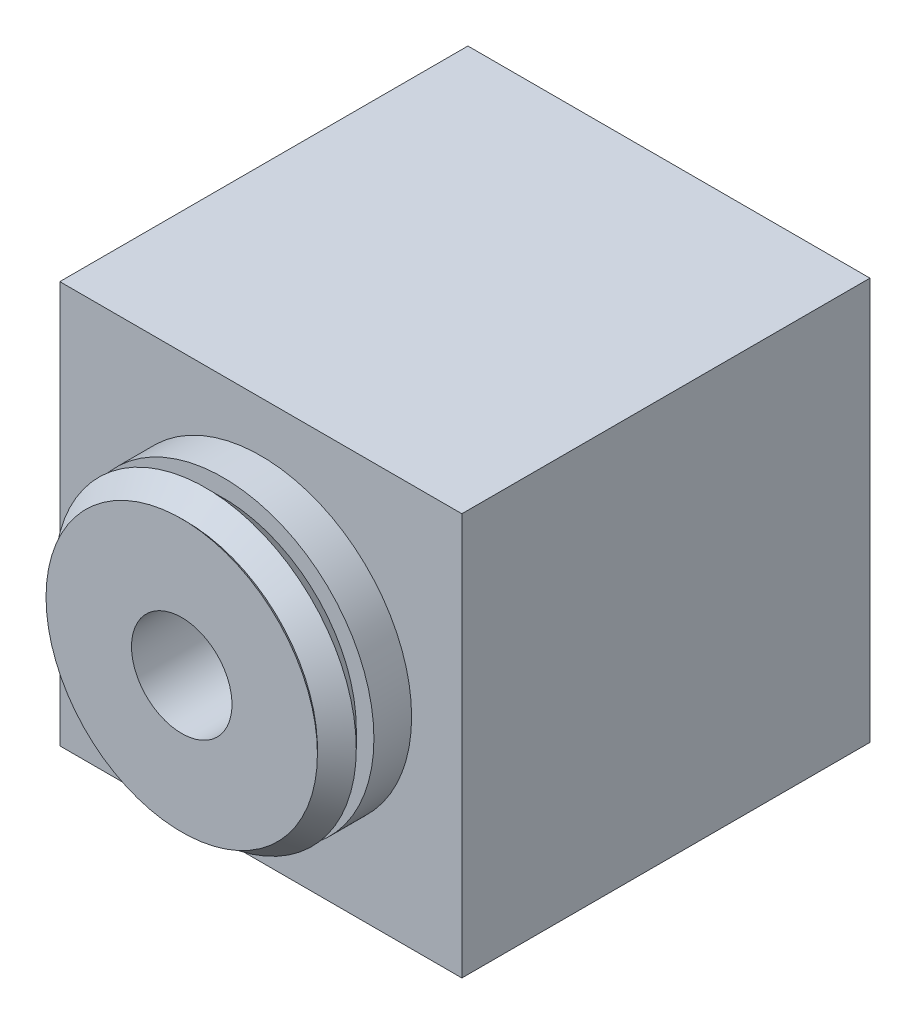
from build123d import *

# Parameters (mm, degrees)
SKETCH9_W                = 20.32
SKETCH9_H                = 20.32
F_BODY_DEPTH             = 20.6248
SKETCH11_R               = 1.7272
F_MOUNTING_HOLES_DEPTH   = 7.9248
SKETCH14_R               = 1.7272
FSR_MOUNTING_HOLES_DEPTH = 4.7498
SKETCH10_R               = 6.35
F_BODY_2_DEPTH           = 1.5748
SKETCH3_R                = 2.54
HOLE_CUT_DEPTH           = 30.87936844


with BuildPart() as part:
    # Sketch1 → Base (revolve)
    with BuildSketch(Plane(origin=(0, 0, 0), x_dir=(0, 0, -1), z_dir=(1, 0, 0)), mode=Mode.PRIVATE) as base_sk:
        Polygon((0, 0), (0, 6.858), (0.21971, 6.63829), (1.20142, 7.62), (2.093214, 6.728206), (2.093214, 7.62), (3.998214, 7.62), (3.998214, 0), align=None)
    revolve(base_sk.sketch.rotate(Axis((0, 0, -71.294124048), (0, 0, 1)), 90), axis=Axis((0, 0, -71.294124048), (0, 0, 1)))

    # Sketch9 → F Body (add)
    with BuildSketch(Plane(origin=(0, 0, -3.998214), x_dir=(-1, 0, 0), z_dir=(0, 0, -1))):
        Rectangle(SKETCH9_W, SKETCH9_H)
    extrude(amount=F_BODY_DEPTH)

    # Sketch11 → F Mounting Holes (cut)
    with BuildSketch(Plane(origin=(0, 0, -24.623014), x_dir=(-1, 0, 0), z_dir=(0, 0, -1))):
        with Locations((6.919507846, 6.550876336)):
            Circle(SKETCH11_R)
        with Locations(Location((-6.550876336, -6.919507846, 0), (0, 0, 180))):
            Circle(SKETCH11_R)
    extrude(amount=-F_MOUNTING_HOLES_DEPTH, mode=Mode.SUBTRACT)

    # Sketch14 → FSR Mounting Holes (cut)
    with BuildSketch(Plane.ZY.offset(10.16)):
        with Locations(Location((-7.173214, 5.5499, 0), (0, 0, 270))):
            Circle(SKETCH14_R)
        with Locations(Location((-18.273014, -5.5499, 0), (0, 0, 270))):
            Circle(SKETCH14_R)
    extrude(amount=-FSR_MOUNTING_HOLES_DEPTH, mode=Mode.SUBTRACT)

    # Sketch10 → F Body 2 (add)
    with BuildSketch(Plane(origin=(0, 0, -24.623014), x_dir=(-1, 0, 0), z_dir=(0, 0, -1))):
        Circle(SKETCH10_R)
    extrude(amount=F_BODY_2_DEPTH)

    # Sketch3 → Hole Cut (cut, through all)
    with BuildSketch(Plane(origin=(0, 0, 0), x_dir=(-1, 0, 0), z_dir=(0, 0, -1))):
        Circle(SKETCH3_R)
    extrude(amount=HOLE_CUT_DEPTH, mode=Mode.SUBTRACT)


solid = part.part
